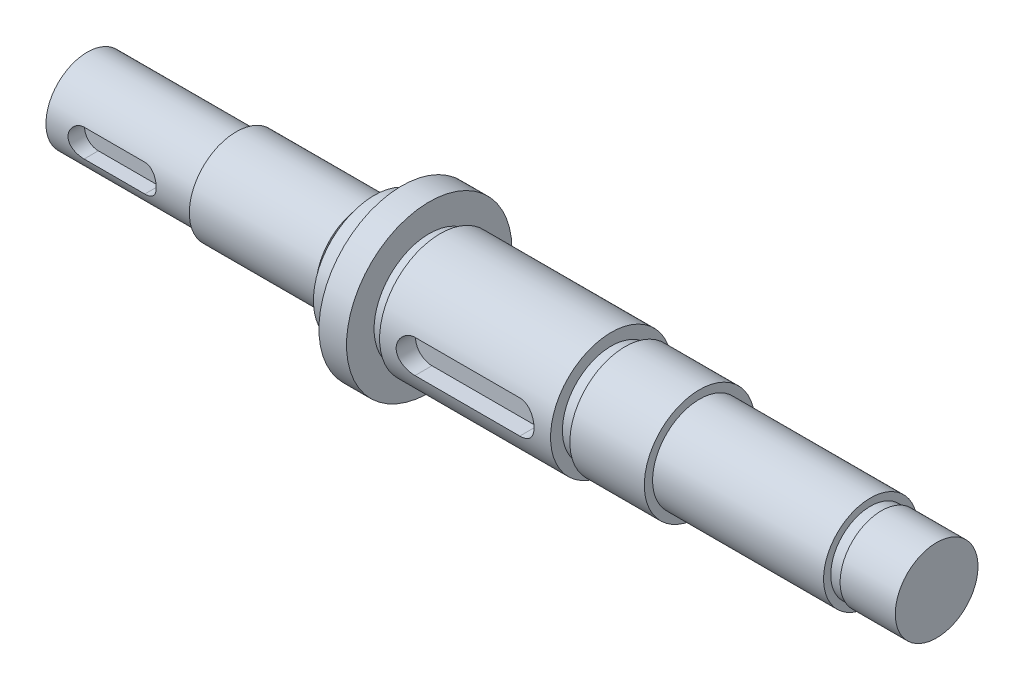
ISO-10303-21;
HEADER;
FILE_DESCRIPTION(('STEP AP214'),'2;1');
FILE_NAME('part.step','',(''),(''),'','','');
FILE_SCHEMA(('AUTOMOTIVE_DESIGN { 1 0 10303 214 1 1 1 1 }'));
ENDSEC;
DATA;
#1=APPLICATION_CONTEXT('core data for automotive mechanical design processes');
#2=APPLICATION_PROTOCOL_DEFINITION('international standard','automotive_design',2000,#1);
#3=PRODUCT_CONTEXT('',#1,'mechanical');
#4=PRODUCT('Part','Part','',(#3));
#5=PRODUCT_RELATED_PRODUCT_CATEGORY('part','',(#4));
#6=PRODUCT_DEFINITION_FORMATION('','',#4);
#7=PRODUCT_DEFINITION_CONTEXT('part definition',#1,'design');
#8=PRODUCT_DEFINITION('design','',#6,#7);
#9=PRODUCT_DEFINITION_SHAPE('','',#8);
#10=(LENGTH_UNIT() NAMED_UNIT(*) SI_UNIT(.MILLI.,.METRE.));
#11=(NAMED_UNIT(*) PLANE_ANGLE_UNIT() SI_UNIT($,.RADIAN.));
#12=(NAMED_UNIT(*) SI_UNIT($,.STERADIAN.) SOLID_ANGLE_UNIT());
#13=UNCERTAINTY_MEASURE_WITH_UNIT(LENGTH_MEASURE(1.E-05),#10,'distance_accuracy_value','');
#14=(GEOMETRIC_REPRESENTATION_CONTEXT(3) GLOBAL_UNCERTAINTY_ASSIGNED_CONTEXT((#13)) GLOBAL_UNIT_ASSIGNED_CONTEXT((#10,
#11,#12)) REPRESENTATION_CONTEXT('',''));
#15=CARTESIAN_POINT('',(0.,0.,0.));
#16=DIRECTION('',(0.,0.,1.));
#17=DIRECTION('',(1.,0.,0.));
#18=AXIS2_PLACEMENT_3D('',#15,#16,#17);
#19=CARTESIAN_POINT('',(142.,0.,0.));
#20=DIRECTION('',(1.,0.,0.));
#21=DIRECTION('',(0.,0.,-1.));
#22=AXIS2_PLACEMENT_3D('',#19,#20,#21);
#23=PLANE('',#22);
#24=CARTESIAN_POINT('',(142.,0.,0.));
#25=DIRECTION('',(1.,0.,0.));
#26=DIRECTION('',(0.,0.,-1.));
#27=AXIS2_PLACEMENT_3D('',#24,#25,#26);
#28=CIRCLE('',#27,8.5);
#29=CARTESIAN_POINT('',(142.,0.,-8.5));
#30=VERTEX_POINT('',#29);
#31=EDGE_CURVE('E164',#30,#30,#28,.T.);
#32=ORIENTED_EDGE('',*,*,#31,.T.);
#33=EDGE_LOOP('',(#32));
#34=FACE_BOUND('',#33,.T.);
#35=CARTESIAN_POINT('',(142.,0.,0.));
#36=DIRECTION('',(1.,0.,0.));
#37=DIRECTION('',(0.,0.,-1.));
#38=AXIS2_PLACEMENT_3D('',#35,#36,#37);
#39=CIRCLE('',#38,7.2);
#40=CARTESIAN_POINT('',(142.,0.,-7.2));
#41=VERTEX_POINT('',#40);
#42=EDGE_CURVE('E155',#41,#41,#39,.T.);
#43=ORIENTED_EDGE('',*,*,#42,.F.);
#44=EDGE_LOOP('',(#43));
#45=FACE_BOUND('',#44,.T.);
#46=ADVANCED_FACE('F31',(#34,#45),#23,.T.);
#47=CARTESIAN_POINT('',(111.,0.,0.));
#48=DIRECTION('',(1.,0.,0.));
#49=DIRECTION('',(0.,0.,-1.));
#50=AXIS2_PLACEMENT_3D('',#47,#48,#49);
#51=PLANE('',#50);
#52=CARTESIAN_POINT('',(111.,0.,0.));
#53=DIRECTION('',(1.,0.,0.));
#54=DIRECTION('',(0.,0.,-1.));
#55=AXIS2_PLACEMENT_3D('',#52,#53,#54);
#56=CIRCLE('',#55,10.);
#57=CARTESIAN_POINT('',(111.,0.,-10.));
#58=VERTEX_POINT('',#57);
#59=EDGE_CURVE('E170',#58,#58,#56,.T.);
#60=ORIENTED_EDGE('',*,*,#59,.T.);
#61=EDGE_LOOP('',(#60));
#62=FACE_BOUND('',#61,.T.);
#63=CARTESIAN_POINT('',(111.,0.,0.));
#64=DIRECTION('',(1.,0.,0.));
#65=DIRECTION('',(0.,0.,-1.));
#66=AXIS2_PLACEMENT_3D('',#63,#64,#65);
#67=CIRCLE('',#66,8.5);
#68=CARTESIAN_POINT('',(111.,0.,-8.5));
#69=VERTEX_POINT('',#68);
#70=EDGE_CURVE('E161',#69,#69,#67,.T.);
#71=ORIENTED_EDGE('',*,*,#70,.F.);
#72=EDGE_LOOP('',(#71));
#73=FACE_BOUND('',#72,.T.);
#74=ADVANCED_FACE('F270',(#62,#73),#51,.T.);
#75=CARTESIAN_POINT('',(95.,0.,0.));
#76=DIRECTION('',(1.,0.,0.));
#77=DIRECTION('',(0.,0.,-1.));
#78=AXIS2_PLACEMENT_3D('',#75,#76,#77);
#79=PLANE('',#78);
#80=CARTESIAN_POINT('',(95.,0.,0.));
#81=DIRECTION('',(1.,0.,0.));
#82=DIRECTION('',(0.,0.,-1.));
#83=AXIS2_PLACEMENT_3D('',#80,#81,#82);
#84=CIRCLE('',#83,11.);
#85=CARTESIAN_POINT('',(95.,0.,-11.));
#86=VERTEX_POINT('',#85);
#87=EDGE_CURVE('E182',#86,#86,#84,.T.);
#88=ORIENTED_EDGE('',*,*,#87,.T.);
#89=EDGE_LOOP('',(#88));
#90=FACE_BOUND('',#89,.T.);
#91=CARTESIAN_POINT('',(95.,0.,0.));
#92=DIRECTION('',(1.,0.,0.));
#93=DIRECTION('',(0.,0.,-1.));
#94=AXIS2_PLACEMENT_3D('',#91,#92,#93);
#95=CIRCLE('',#94,8.85);
#96=CARTESIAN_POINT('',(95.,0.,-8.85));
#97=VERTEX_POINT('',#96);
#98=EDGE_CURVE('E173',#97,#97,#95,.T.);
#99=ORIENTED_EDGE('',*,*,#98,.F.);
#100=EDGE_LOOP('',(#99));
#101=FACE_BOUND('',#100,.T.);
#102=ADVANCED_FACE('F278',(#90,#101),#79,.T.);
#103=CARTESIAN_POINT('',(62.,0.,0.));
#104=DIRECTION('',(1.,0.,0.));
#105=DIRECTION('',(0.,0.,-1.));
#106=AXIS2_PLACEMENT_3D('',#103,#104,#105);
#107=PLANE('',#106);
#108=CARTESIAN_POINT('',(62.,0.,0.));
#109=DIRECTION('',(1.,0.,0.));
#110=DIRECTION('',(0.,0.,-1.));
#111=AXIS2_PLACEMENT_3D('',#108,#109,#110);
#112=CIRCLE('',#111,15.);
#113=CARTESIAN_POINT('',(62.,0.,-15.));
#114=VERTEX_POINT('',#113);
#115=EDGE_CURVE('E194',#114,#114,#112,.T.);
#116=ORIENTED_EDGE('',*,*,#115,.T.);
#117=EDGE_LOOP('',(#116));
#118=FACE_BOUND('',#117,.T.);
#119=CARTESIAN_POINT('',(62.,0.,0.));
#120=DIRECTION('',(1.,0.,0.));
#121=DIRECTION('',(0.,0.,-1.));
#122=AXIS2_PLACEMENT_3D('',#119,#120,#121);
#123=CIRCLE('',#122,10.);
#124=CARTESIAN_POINT('',(62.,0.,-10.));
#125=VERTEX_POINT('',#124);
#126=EDGE_CURVE('E185',#125,#125,#123,.T.);
#127=ORIENTED_EDGE('',*,*,#126,.F.);
#128=EDGE_LOOP('',(#127));
#129=FACE_BOUND('',#128,.T.);
#130=ADVANCED_FACE('F294',(#118,#129),#107,.T.);
#131=CARTESIAN_POINT('',(50.,0.,0.));
#132=DIRECTION('',(1.,0.,0.));
#133=DIRECTION('',(0.,0.,-1.));
#134=AXIS2_PLACEMENT_3D('',#131,#132,#133);
#135=PLANE('',#134);
#136=CARTESIAN_POINT('',(50.,0.,0.));
#137=DIRECTION('',(1.,0.,0.));
#138=DIRECTION('',(0.,0.,-1.));
#139=AXIS2_PLACEMENT_3D('',#136,#137,#138);
#140=CIRCLE('',#139,8.5);
#141=CARTESIAN_POINT('',(50.,0.,-8.5));
#142=VERTEX_POINT('',#141);
#143=EDGE_CURVE('E212',#142,#142,#140,.T.);
#144=ORIENTED_EDGE('',*,*,#143,.T.);
#145=EDGE_LOOP('',(#144));
#146=FACE_BOUND('',#145,.T.);
#147=CARTESIAN_POINT('',(50.,0.,0.));
#148=DIRECTION('',(1.,0.,0.));
#149=DIRECTION('',(0.,0.,-1.));
#150=AXIS2_PLACEMENT_3D('',#147,#148,#149);
#151=CIRCLE('',#150,8.2);
#152=CARTESIAN_POINT('',(50.,0.,-8.2));
#153=VERTEX_POINT('',#152);
#154=EDGE_CURVE('E203',#153,#153,#151,.T.);
#155=ORIENTED_EDGE('',*,*,#154,.F.);
#156=EDGE_LOOP('',(#155));
#157=FACE_BOUND('',#156,.T.);
#158=ADVANCED_FACE('F341',(#146,#157),#135,.T.);
#159=CARTESIAN_POINT('',(27.,0.,0.));
#160=DIRECTION('',(-1.,0.,0.));
#161=DIRECTION('',(0.,0.,1.));
#162=AXIS2_PLACEMENT_3D('',#159,#160,#161);
#163=CYLINDRICAL_SURFACE('',#162,7.5);
#164=DIRECTION('',(-1.,0.,0.));
#165=VECTOR('',#164,1.);
#166=CARTESIAN_POINT('',(27.,2.5,7.07106781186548));
#167=LINE('',#166,#165);
#168=CARTESIAN_POINT('',(6.5,2.5,7.07106781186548));
#169=VERTEX_POINT('',#168);
#170=CARTESIAN_POINT('',(17.5,2.5,7.07106781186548));
#171=VERTEX_POINT('',#170);
#172=EDGE_CURVE('E335',#169,#171,#167,.F.);
#173=ORIENTED_EDGE('',*,*,#172,.T.);
#174=CARTESIAN_POINT('',(17.5,2.5,7.07106781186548));
#175=CARTESIAN_POINT('',(17.5682070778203,2.50000899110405,7.07105693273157));
#176=CARTESIAN_POINT('',(17.6364080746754,2.49720887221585,7.07205443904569));
#177=CARTESIAN_POINT('',(17.7722810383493,2.4860604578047,7.07598524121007));
#178=CARTESIAN_POINT('',(17.8399531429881,2.47771365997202,7.07891801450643));
#179=CARTESIAN_POINT('',(17.9740904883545,2.45557459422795,7.08662705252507));
#180=CARTESIAN_POINT('',(18.0405587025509,2.44179847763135,7.09139784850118));
#181=CARTESIAN_POINT('',(18.1720082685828,2.4089418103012,7.10262619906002));
#182=CARTESIAN_POINT('',(18.2369895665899,2.38986106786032,7.10908381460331));
#183=CARTESIAN_POINT('',(18.4289615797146,2.32491551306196,7.13069940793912));
#184=CARTESIAN_POINT('',(18.55317915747,2.2713141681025,7.14811243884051));
#185=CARTESIAN_POINT('',(18.7908768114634,2.14517784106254,7.1869703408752));
#186=CARTESIAN_POINT('',(18.9043502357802,2.07263123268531,7.20841768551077));
#187=CARTESIAN_POINT('',(19.1217929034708,1.90762995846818,7.25386182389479));
#188=CARTESIAN_POINT('',(19.2252851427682,1.81456284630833,7.27792189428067));
#189=CARTESIAN_POINT('',(19.4155171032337,1.61247071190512,7.32534626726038));
#190=CARTESIAN_POINT('',(19.502253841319,1.50344285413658,7.34871044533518));
#191=CARTESIAN_POINT('',(19.6586982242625,1.26900922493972,7.39284706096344));
#192=CARTESIAN_POINT('',(19.7279023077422,1.14325025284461,7.41353593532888));
#193=CARTESIAN_POINT('',(19.8439807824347,0.881073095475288,7.44924021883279));
#194=CARTESIAN_POINT('',(19.8908619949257,0.744658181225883,7.46425736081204));
#195=CARTESIAN_POINT('',(19.9593392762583,0.470073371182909,7.48647677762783));
#196=CARTESIAN_POINT('',(19.9817581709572,0.332129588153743,7.49393272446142));
#197=CARTESIAN_POINT('',(20.0032907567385,0.0542474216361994,7.50109021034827));
#198=CARTESIAN_POINT('',(20.0024100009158,-0.0856904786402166,7.50079359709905));
#199=CARTESIAN_POINT('',(19.9778892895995,-0.357759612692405,7.49265096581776));
#200=CARTESIAN_POINT('',(19.9551434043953,-0.489981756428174,7.48510152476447));
#201=CARTESIAN_POINT('',(19.8890170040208,-0.748610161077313,7.46367401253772));
#202=CARTESIAN_POINT('',(19.8456353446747,-0.875016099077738,7.44979559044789));
#203=CARTESIAN_POINT('',(19.7389465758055,-1.12038155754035,7.41689170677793));
#204=CARTESIAN_POINT('',(19.6753848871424,-1.23922126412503,7.39780094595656));
#205=CARTESIAN_POINT('',(19.530350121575,-1.46481147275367,7.35645969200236));
#206=CARTESIAN_POINT('',(19.4488721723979,-1.57155867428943,7.33420833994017));
#207=CARTESIAN_POINT('',(19.2658223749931,-1.77524334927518,7.28765679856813));
#208=CARTESIAN_POINT('',(19.1634861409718,-1.87148402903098,7.26330946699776));
#209=CARTESIAN_POINT('',(18.9438962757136,-2.04568006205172,7.21618726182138));
#210=CARTESIAN_POINT('',(18.826637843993,-2.12362950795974,7.19341289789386));
#211=CARTESIAN_POINT('',(18.5782995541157,-2.26000831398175,7.15175078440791));
#212=CARTESIAN_POINT('',(18.4470412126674,-2.31813252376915,7.13292537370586));
#213=CARTESIAN_POINT('',(18.1758825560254,-2.41115057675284,7.10202742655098));
#214=CARTESIAN_POINT('',(18.0359962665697,-2.4460810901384,7.08994423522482));
#215=CARTESIAN_POINT('',(17.82895340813,-2.47914539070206,7.078413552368));
#216=CARTESIAN_POINT('',(17.7633965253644,-2.48696265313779,7.07566669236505));
#217=CARTESIAN_POINT('',(17.6319048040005,-2.49738654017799,7.07199258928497));
#218=CARTESIAN_POINT('',(17.565970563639,-2.49999988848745,7.0710629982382));
#219=CARTESIAN_POINT('',(17.5,-2.5,7.07106781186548));
#220=B_SPLINE_CURVE_WITH_KNOTS('',3,(#174,#175,#176,#177,#178,#179,#180,#181,#182,#183,#184,
#185,#186,#187,#188,#189,#190,#191,#192,#193,#194,#195,#196,#197,#198,#199,#200,#201,#202,#203,
#204,#205,#206,#207,#208,#209,#210,#211,#212,#213,#214,#215,#216,#217,#218,#219),.UNSPECIFIED.,
.F.,.F.,(4,2,2,2,2,2,2,2,2,2,2,2,2,2,2,2,2,2,2,2,2,2,4),(0.,0.204546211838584,0.409037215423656,
0.612924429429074,0.816819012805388,1.22401016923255,1.63145179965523,2.05327864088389,
2.47518051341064,2.90809434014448,3.34087579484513,3.75860278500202,4.17623021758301,
4.57747647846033,4.97874498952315,5.38529148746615,5.79194868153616,6.21771736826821,
6.64362337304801,7.07581676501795,7.50732520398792,7.70536340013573,7.90314555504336),.UNSPECIFIED.);
#221=CARTESIAN_POINT('',(17.5,-2.5,7.07106781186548));
#222=VERTEX_POINT('',#221);
#223=EDGE_CURVE('E221',#171,#222,#220,.T.);
#224=ORIENTED_EDGE('',*,*,#223,.T.);
#225=DIRECTION('',(-1.,0.,0.));
#226=VECTOR('',#225,1.);
#227=CARTESIAN_POINT('',(27.,-2.5,7.07106781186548));
#228=LINE('',#227,#226);
#229=CARTESIAN_POINT('',(6.5,-2.5,7.07106781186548));
#230=VERTEX_POINT('',#229);
#231=EDGE_CURVE('E332',#222,#230,#228,.T.);
#232=ORIENTED_EDGE('',*,*,#231,.T.);
#233=CARTESIAN_POINT('',(6.5,-2.5,7.07106781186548));
#234=CARTESIAN_POINT('',(6.43179292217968,-2.50000899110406,7.07105693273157));
#235=CARTESIAN_POINT('',(6.36359192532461,-2.49720887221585,7.07205443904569));
#236=CARTESIAN_POINT('',(6.22771896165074,-2.4860604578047,7.07598524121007));
#237=CARTESIAN_POINT('',(6.16004685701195,-2.47771365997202,7.07891801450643));
#238=CARTESIAN_POINT('',(6.02590951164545,-2.45557459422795,7.08662705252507));
#239=CARTESIAN_POINT('',(5.95944129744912,-2.44179847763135,7.09139784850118));
#240=CARTESIAN_POINT('',(5.82799173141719,-2.4089418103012,7.10262619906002));
#241=CARTESIAN_POINT('',(5.7630104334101,-2.38986106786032,7.10908381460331));
#242=CARTESIAN_POINT('',(5.57103842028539,-2.32491551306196,7.13069940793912));
#243=CARTESIAN_POINT('',(5.44682084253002,-2.2713141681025,7.14811243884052));
#244=CARTESIAN_POINT('',(5.20912318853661,-2.14517784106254,7.1869703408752));
#245=CARTESIAN_POINT('',(5.09564976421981,-2.07263123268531,7.20841768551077));
#246=CARTESIAN_POINT('',(4.8782070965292,-1.90762995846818,7.25386182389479));
#247=CARTESIAN_POINT('',(4.7747148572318,-1.81456284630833,7.27792189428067));
#248=CARTESIAN_POINT('',(4.58448289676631,-1.61247071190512,7.32534626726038));
#249=CARTESIAN_POINT('',(4.497746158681,-1.50344285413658,7.34871044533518));
#250=CARTESIAN_POINT('',(4.34130177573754,-1.26900922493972,7.39284706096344));
#251=CARTESIAN_POINT('',(4.27209769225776,-1.1432502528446,7.41353593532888));
#252=CARTESIAN_POINT('',(4.1560192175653,-0.881073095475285,7.44924021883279));
#253=CARTESIAN_POINT('',(4.10913800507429,-0.744658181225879,7.46425736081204));
#254=CARTESIAN_POINT('',(4.04066072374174,-0.470073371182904,7.48647677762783));
#255=CARTESIAN_POINT('',(4.01824182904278,-0.332129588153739,7.49393272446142));
#256=CARTESIAN_POINT('',(3.99670924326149,-0.0542474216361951,7.50109021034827));
#257=CARTESIAN_POINT('',(3.99758999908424,0.0856904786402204,7.50079359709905));
#258=CARTESIAN_POINT('',(4.0221107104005,0.357759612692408,7.49265096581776));
#259=CARTESIAN_POINT('',(4.04485659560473,0.489981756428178,7.48510152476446));
#260=CARTESIAN_POINT('',(4.11098299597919,0.748610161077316,7.46367401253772));
#261=CARTESIAN_POINT('',(4.15436465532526,0.875016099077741,7.44979559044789));
#262=CARTESIAN_POINT('',(4.26105342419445,1.12038155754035,7.41689170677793));
#263=CARTESIAN_POINT('',(4.32461511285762,1.23922126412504,7.39780094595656));
#264=CARTESIAN_POINT('',(4.46964987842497,1.46481147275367,7.35645969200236));
#265=CARTESIAN_POINT('',(4.55112782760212,1.57155867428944,7.33420833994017));
#266=CARTESIAN_POINT('',(4.73417762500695,1.77524334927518,7.28765679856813));
#267=CARTESIAN_POINT('',(4.83651385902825,1.87148402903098,7.26330946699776));
#268=CARTESIAN_POINT('',(5.05610372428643,2.04568006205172,7.21618726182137));
#269=CARTESIAN_POINT('',(5.17336215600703,2.12362950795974,7.19341289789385));
#270=CARTESIAN_POINT('',(5.42170044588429,2.26000831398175,7.15175078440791));
#271=CARTESIAN_POINT('',(5.55295878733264,2.31813252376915,7.13292537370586));
#272=CARTESIAN_POINT('',(5.8241174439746,2.41115057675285,7.10202742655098));
#273=CARTESIAN_POINT('',(5.96400373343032,2.4460810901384,7.08994423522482));
#274=CARTESIAN_POINT('',(6.17104659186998,2.47914539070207,7.078413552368));
#275=CARTESIAN_POINT('',(6.23660347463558,2.48696265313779,7.07566669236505));
#276=CARTESIAN_POINT('',(6.36809519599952,2.49738654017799,7.07199258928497));
#277=CARTESIAN_POINT('',(6.43402943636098,2.49999988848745,7.0710629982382));
#278=CARTESIAN_POINT('',(6.5,2.5,7.07106781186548));
#279=B_SPLINE_CURVE_WITH_KNOTS('',3,(#233,#234,#235,#236,#237,#238,#239,#240,#241,#242,#243,
#244,#245,#246,#247,#248,#249,#250,#251,#252,#253,#254,#255,#256,#257,#258,#259,#260,#261,#262,
#263,#264,#265,#266,#267,#268,#269,#270,#271,#272,#273,#274,#275,#276,#277,#278),.UNSPECIFIED.,
.F.,.F.,(4,2,2,2,2,2,2,2,2,2,2,2,2,2,2,2,2,2,2,2,2,2,4),(0.,0.204546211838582,0.409037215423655,
0.612924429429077,0.816819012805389,1.22401016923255,1.63145179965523,2.0532786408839,
2.47518051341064,2.90809434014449,3.34087579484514,3.75860278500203,4.17623021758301,
4.57747647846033,4.97874498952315,5.38529148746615,5.79194868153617,6.21771736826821,
6.64362337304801,7.07581676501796,7.50732520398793,7.70536340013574,7.90314555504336),.UNSPECIFIED.);
#280=EDGE_CURVE('E55',#230,#169,#279,.T.);
#281=ORIENTED_EDGE('',*,*,#280,.T.);
#282=EDGE_LOOP('',(#173,#224,#232,#281));
#283=FACE_BOUND('',#282,.T.);
#284=CARTESIAN_POINT('',(27.,0.,0.));
#285=DIRECTION('',(1.,0.,0.));
#286=DIRECTION('',(0.,0.,-1.));
#287=AXIS2_PLACEMENT_3D('',#284,#285,#286);
#288=CIRCLE('',#287,7.5);
#289=CARTESIAN_POINT('',(27.,0.,-7.5));
#290=VERTEX_POINT('',#289);
#291=EDGE_CURVE('E218',#290,#290,#288,.T.);
#292=ORIENTED_EDGE('',*,*,#291,.F.);
#293=EDGE_LOOP('',(#292));
#294=FACE_BOUND('',#293,.T.);
#295=CARTESIAN_POINT('',(0.,0.,0.));
#296=DIRECTION('',(1.,0.,0.));
#297=DIRECTION('',(0.,0.,-1.));
#298=AXIS2_PLACEMENT_3D('',#295,#296,#297);
#299=CIRCLE('',#298,7.5);
#300=CARTESIAN_POINT('',(0.,0.,-7.5));
#301=VERTEX_POINT('',#300);
#302=EDGE_CURVE('E215',#301,#301,#299,.T.);
#303=ORIENTED_EDGE('',*,*,#302,.T.);
#304=EDGE_LOOP('',(#303));
#305=FACE_BOUND('',#304,.T.);
#306=ADVANCED_FACE('F33',(#283,#294,#305),#163,.T.);
#307=CARTESIAN_POINT('',(0.,0.,0.));
#308=DIRECTION('',(1.,0.,0.));
#309=DIRECTION('',(0.,0.,-1.));
#310=AXIS2_PLACEMENT_3D('',#307,#308,#309);
#311=PLANE('',#310);
#312=ORIENTED_EDGE('',*,*,#302,.F.);
#313=EDGE_LOOP('',(#312));
#314=FACE_BOUND('',#313,.T.);
#315=ADVANCED_FACE('F340',(#314),#311,.F.);
#316=CARTESIAN_POINT('',(27.,0.,0.));
#317=DIRECTION('',(1.,0.,0.));
#318=DIRECTION('',(0.,0.,-1.));
#319=AXIS2_PLACEMENT_3D('',#316,#317,#318);
#320=PLANE('',#319);
#321=CARTESIAN_POINT('',(27.,0.,0.));
#322=DIRECTION('',(1.,0.,0.));
#323=DIRECTION('',(0.,0.,-1.));
#324=AXIS2_PLACEMENT_3D('',#321,#322,#323);
#325=CIRCLE('',#324,8.5);
#326=CARTESIAN_POINT('',(27.,0.,-8.5));
#327=VERTEX_POINT('',#326);
#328=EDGE_CURVE('E209',#327,#327,#325,.T.);
#329=ORIENTED_EDGE('',*,*,#328,.F.);
#330=EDGE_LOOP('',(#329));
#331=FACE_BOUND('',#330,.T.);
#332=ORIENTED_EDGE('',*,*,#291,.T.);
#333=EDGE_LOOP('',(#332));
#334=FACE_BOUND('',#333,.T.);
#335=ADVANCED_FACE('F347',(#331,#334),#320,.F.);
#336=CARTESIAN_POINT('',(50.,0.,0.));
#337=DIRECTION('',(-1.,0.,0.));
#338=DIRECTION('',(0.,0.,1.));
#339=AXIS2_PLACEMENT_3D('',#336,#337,#338);
#340=CYLINDRICAL_SURFACE('',#339,8.5);
#341=ORIENTED_EDGE('',*,*,#143,.F.);
#342=EDGE_LOOP('',(#341));
#343=FACE_BOUND('',#342,.T.);
#344=ORIENTED_EDGE('',*,*,#328,.T.);
#345=EDGE_LOOP('',(#344));
#346=FACE_BOUND('',#345,.T.);
#347=ADVANCED_FACE('F351',(#343,#346),#340,.T.);
#348=CARTESIAN_POINT('',(52.,0.,0.));
#349=DIRECTION('',(-1.,0.,0.));
#350=DIRECTION('',(0.,0.,1.));
#351=AXIS2_PLACEMENT_3D('',#348,#349,#350);
#352=CYLINDRICAL_SURFACE('',#351,8.2);
#353=CARTESIAN_POINT('',(52.,0.,0.));
#354=DIRECTION('',(1.,0.,0.));
#355=DIRECTION('',(0.,0.,-1.));
#356=AXIS2_PLACEMENT_3D('',#353,#354,#355);
#357=CIRCLE('',#356,8.2);
#358=CARTESIAN_POINT('',(52.,0.,-8.2));
#359=VERTEX_POINT('',#358);
#360=EDGE_CURVE('E206',#359,#359,#357,.T.);
#361=ORIENTED_EDGE('',*,*,#360,.F.);
#362=EDGE_LOOP('',(#361));
#363=FACE_BOUND('',#362,.T.);
#364=ORIENTED_EDGE('',*,*,#154,.T.);
#365=EDGE_LOOP('',(#364));
#366=FACE_BOUND('',#365,.T.);
#367=ADVANCED_FACE('F356',(#363,#366),#352,.T.);
#368=CARTESIAN_POINT('',(52.,0.,0.));
#369=DIRECTION('',(1.,0.,0.));
#370=DIRECTION('',(0.,0.,-1.));
#371=AXIS2_PLACEMENT_3D('',#368,#369,#370);
#372=PLANE('',#371);
#373=CARTESIAN_POINT('',(52.,0.,0.));
#374=DIRECTION('',(1.,0.,0.));
#375=DIRECTION('',(0.,0.,-1.));
#376=AXIS2_PLACEMENT_3D('',#373,#374,#375);
#377=CIRCLE('',#376,11.);
#378=CARTESIAN_POINT('',(52.,0.,-11.));
#379=VERTEX_POINT('',#378);
#380=EDGE_CURVE('E197',#379,#379,#377,.T.);
#381=ORIENTED_EDGE('',*,*,#380,.F.);
#382=EDGE_LOOP('',(#381));
#383=FACE_BOUND('',#382,.T.);
#384=ORIENTED_EDGE('',*,*,#360,.T.);
#385=EDGE_LOOP('',(#384));
#386=FACE_BOUND('',#385,.T.);
#387=ADVANCED_FACE('F364',(#383,#386),#372,.F.);
#388=CARTESIAN_POINT('',(57.,0.,0.));
#389=DIRECTION('',(-1.,0.,0.));
#390=DIRECTION('',(0.,0.,1.));
#391=AXIS2_PLACEMENT_3D('',#388,#389,#390);
#392=CYLINDRICAL_SURFACE('',#391,11.);
#393=CARTESIAN_POINT('',(57.,0.,0.));
#394=DIRECTION('',(1.,0.,0.));
#395=DIRECTION('',(0.,0.,-1.));
#396=AXIS2_PLACEMENT_3D('',#393,#394,#395);
#397=CIRCLE('',#396,11.);
#398=CARTESIAN_POINT('',(57.,0.,-11.));
#399=VERTEX_POINT('',#398);
#400=EDGE_CURVE('E200',#399,#399,#397,.T.);
#401=ORIENTED_EDGE('',*,*,#400,.F.);
#402=EDGE_LOOP('',(#401));
#403=FACE_BOUND('',#402,.T.);
#404=ORIENTED_EDGE('',*,*,#380,.T.);
#405=EDGE_LOOP('',(#404));
#406=FACE_BOUND('',#405,.T.);
#407=ADVANCED_FACE('F366',(#403,#406),#392,.T.);
#408=CARTESIAN_POINT('',(57.,0.,0.));
#409=DIRECTION('',(1.,0.,0.));
#410=DIRECTION('',(0.,0.,-1.));
#411=AXIS2_PLACEMENT_3D('',#408,#409,#410);
#412=PLANE('',#411);
#413=CARTESIAN_POINT('',(57.,0.,0.));
#414=DIRECTION('',(1.,0.,0.));
#415=DIRECTION('',(0.,0.,-1.));
#416=AXIS2_PLACEMENT_3D('',#413,#414,#415);
#417=CIRCLE('',#416,15.);
#418=CARTESIAN_POINT('',(57.,0.,-15.));
#419=VERTEX_POINT('',#418);
#420=EDGE_CURVE('E191',#419,#419,#417,.T.);
#421=ORIENTED_EDGE('',*,*,#420,.F.);
#422=EDGE_LOOP('',(#421));
#423=FACE_BOUND('',#422,.T.);
#424=ORIENTED_EDGE('',*,*,#400,.T.);
#425=EDGE_LOOP('',(#424));
#426=FACE_BOUND('',#425,.T.);
#427=ADVANCED_FACE('F369',(#423,#426),#412,.F.);
#428=CARTESIAN_POINT('',(62.,0.,0.));
#429=DIRECTION('',(-1.,0.,0.));
#430=DIRECTION('',(0.,0.,1.));
#431=AXIS2_PLACEMENT_3D('',#428,#429,#430);
#432=CYLINDRICAL_SURFACE('',#431,15.);
#433=ORIENTED_EDGE('',*,*,#115,.F.);
#434=EDGE_LOOP('',(#433));
#435=FACE_BOUND('',#434,.T.);
#436=ORIENTED_EDGE('',*,*,#420,.T.);
#437=EDGE_LOOP('',(#436));
#438=FACE_BOUND('',#437,.T.);
#439=ADVANCED_FACE('F374',(#435,#438),#432,.T.);
#440=CARTESIAN_POINT('',(64.,0.,0.));
#441=DIRECTION('',(-1.,0.,0.));
#442=DIRECTION('',(0.,0.,1.));
#443=AXIS2_PLACEMENT_3D('',#440,#441,#442);
#444=CYLINDRICAL_SURFACE('',#443,10.);
#445=CARTESIAN_POINT('',(64.,0.,0.));
#446=DIRECTION('',(1.,0.,0.));
#447=DIRECTION('',(0.,0.,-1.));
#448=AXIS2_PLACEMENT_3D('',#445,#446,#447);
#449=CIRCLE('',#448,10.);
#450=CARTESIAN_POINT('',(64.,0.,-10.));
#451=VERTEX_POINT('',#450);
#452=EDGE_CURVE('E188',#451,#451,#449,.T.);
#453=ORIENTED_EDGE('',*,*,#452,.F.);
#454=EDGE_LOOP('',(#453));
#455=FACE_BOUND('',#454,.T.);
#456=ORIENTED_EDGE('',*,*,#126,.T.);
#457=EDGE_LOOP('',(#456));
#458=FACE_BOUND('',#457,.T.);
#459=ADVANCED_FACE('F299',(#455,#458),#444,.T.);
#460=CARTESIAN_POINT('',(64.,0.,0.));
#461=DIRECTION('',(1.,0.,0.));
#462=DIRECTION('',(0.,0.,-1.));
#463=AXIS2_PLACEMENT_3D('',#460,#461,#462);
#464=PLANE('',#463);
#465=CARTESIAN_POINT('',(64.,0.,0.));
#466=DIRECTION('',(1.,0.,0.));
#467=DIRECTION('',(0.,0.,-1.));
#468=AXIS2_PLACEMENT_3D('',#465,#466,#467);
#469=CIRCLE('',#468,11.);
#470=CARTESIAN_POINT('',(64.,0.,-11.));
#471=VERTEX_POINT('',#470);
#472=EDGE_CURVE('E179',#471,#471,#469,.T.);
#473=ORIENTED_EDGE('',*,*,#472,.F.);
#474=EDGE_LOOP('',(#473));
#475=FACE_BOUND('',#474,.T.);
#476=ORIENTED_EDGE('',*,*,#452,.T.);
#477=EDGE_LOOP('',(#476));
#478=FACE_BOUND('',#477,.T.);
#479=ADVANCED_FACE('F296',(#475,#478),#464,.F.);
#480=CARTESIAN_POINT('',(95.,0.,0.));
#481=DIRECTION('',(-1.,0.,0.));
#482=DIRECTION('',(0.,0.,1.));
#483=AXIS2_PLACEMENT_3D('',#480,#481,#482);
#484=CYLINDRICAL_SURFACE('',#483,11.);
#485=DIRECTION('',(-1.,0.,0.));
#486=VECTOR('',#485,1.);
#487=CARTESIAN_POINT('',(95.,3.00000000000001,10.5830052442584));
#488=LINE('',#487,#486);
#489=CARTESIAN_POINT('',(70.,3.00000000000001,10.5830052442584));
#490=VERTEX_POINT('',#489);
#491=CARTESIAN_POINT('',(89.,3.00000000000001,10.5830052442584));
#492=VERTEX_POINT('',#491);
#493=EDGE_CURVE('E11',#490,#492,#488,.F.);
#494=ORIENTED_EDGE('',*,*,#493,.T.);
#495=CARTESIAN_POINT('',(89.,3.00000000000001,10.5830052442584));
#496=CARTESIAN_POINT('',(89.0826938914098,3.0000098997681,10.5829949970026));
#497=CARTESIAN_POINT('',(89.165381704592,2.99658102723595,10.5839742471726));
#498=CARTESIAN_POINT('',(89.3301335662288,2.98292268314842,10.5878356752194));
#499=CARTESIAN_POINT('',(89.4121977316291,2.97269452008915,10.5907174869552));
#500=CARTESIAN_POINT('',(89.5749425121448,2.94554459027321,10.598299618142));
#501=CARTESIAN_POINT('',(89.6556257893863,2.92863770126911,10.6029958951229));
#502=CARTESIAN_POINT('',(89.8152032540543,2.8882912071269,10.6140571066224));
#503=CARTESIAN_POINT('',(89.8940974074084,2.8648514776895,10.6204220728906));
#504=CARTESIAN_POINT('',(90.127242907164,2.78500332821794,10.6417494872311));
#505=CARTESIAN_POINT('',(90.2781393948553,2.71903526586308,10.6589535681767));
#506=CARTESIAN_POINT('',(90.5667053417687,2.56365897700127,10.6973836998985));
#507=CARTESIAN_POINT('',(90.704370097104,2.47424245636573,10.7186111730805));
#508=CARTESIAN_POINT('',(90.9662097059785,2.27200424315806,10.7633148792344));
#509=CARTESIAN_POINT('',(91.0899918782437,2.15868225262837,10.7868322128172));
#510=CARTESIAN_POINT('',(91.3170514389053,1.91292298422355,10.8331129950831));
#511=CARTESIAN_POINT('',(91.4203254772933,1.78048258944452,10.8558763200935));
#512=CARTESIAN_POINT('',(91.6050989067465,1.49749198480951,10.8985459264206));
#513=CARTESIAN_POINT('',(91.686203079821,1.34667477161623,10.9183977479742));
#514=CARTESIAN_POINT('',(91.8217484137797,1.03291980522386,10.9525311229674));
#515=CARTESIAN_POINT('',(91.8761955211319,0.869984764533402,10.9668139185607));
#516=CARTESIAN_POINT('',(91.9556017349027,0.540744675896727,10.9879090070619));
#517=CARTESIAN_POINT('',(91.9812343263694,0.374613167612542,10.9948916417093));
#518=CARTESIAN_POINT('',(92.004404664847,0.0402673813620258,11.0011960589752));
#519=CARTESIAN_POINT('',(92.0019467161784,-0.127946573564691,11.0005190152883));
#520=CARTESIAN_POINT('',(91.9694751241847,-0.456980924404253,10.9917041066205));
#521=CARTESIAN_POINT('',(91.9401899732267,-0.617879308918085,10.9837634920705));
#522=CARTESIAN_POINT('',(91.8560747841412,-0.932383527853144,10.9615477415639));
#523=CARTESIAN_POINT('',(91.8012435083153,-1.08598900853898,10.9472722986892));
#524=CARTESIAN_POINT('',(91.667045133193,-1.38338788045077,10.9137016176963));
#525=CARTESIAN_POINT('',(91.5874317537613,-1.52706425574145,10.8943563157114));
#526=CARTESIAN_POINT('',(91.4061201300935,-1.79926098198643,10.8527253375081));
#527=CARTESIAN_POINT('',(91.3044178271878,-1.92777854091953,10.830439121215));
#528=CARTESIAN_POINT('',(91.0779767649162,-2.17034844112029,10.7844948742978));
#529=CARTESIAN_POINT('',(90.952605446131,-2.28380693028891,10.760815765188));
#530=CARTESIAN_POINT('',(90.6843376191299,-2.48826234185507,10.7153886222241));
#531=CARTESIAN_POINT('',(90.541436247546,-2.57925300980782,10.6936411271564));
#532=CARTESIAN_POINT('',(90.240805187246,-2.73667910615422,10.6544469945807));
#533=CARTESIAN_POINT('',(90.0829757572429,-2.80293223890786,10.6370325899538));
#534=CARTESIAN_POINT('',(89.757912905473,-2.90768324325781,10.6088816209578));
#535=CARTESIAN_POINT('',(89.5906940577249,-2.9462229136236,10.598135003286));
#536=CARTESIAN_POINT('',(89.3516455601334,-2.98015870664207,10.588613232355));
#537=CARTESIAN_POINT('',(89.2814835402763,-2.98759962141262,10.5865140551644));
#538=CARTESIAN_POINT('',(89.1408924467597,-2.99751512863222,10.58371035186));
#539=CARTESIAN_POINT('',(89.0704639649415,-2.99999749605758,10.5830036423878));
#540=CARTESIAN_POINT('',(89.,-3.00000000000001,10.5830052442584));
#541=B_SPLINE_CURVE_WITH_KNOTS('',3,(#495,#496,#497,#498,#499,#500,#501,#502,#503,#504,#505,
#506,#507,#508,#509,#510,#511,#512,#513,#514,#515,#516,#517,#518,#519,#520,#521,#522,#523,#524,
#525,#526,#527,#528,#529,#530,#531,#532,#533,#534,#535,#536,#537,#538,#539,#540),.UNSPECIFIED.,
.F.,.F.,(4,2,2,2,2,2,2,2,2,2,2,2,2,2,2,2,2,2,2,2,2,2,4),(0.,0.247994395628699,0.495941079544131,
0.743338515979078,0.99074065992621,1.48499724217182,1.97942888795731,2.4854708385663,
2.99159538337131,3.50622794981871,4.02074566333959,4.52296979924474,5.0251169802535,
5.51402000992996,6.00294672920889,6.4968964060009,6.99093691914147,7.50077286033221,
8.01075056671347,8.52441550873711,9.03730408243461,9.24891043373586,9.46018472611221),.UNSPECIFIED.);
#542=CARTESIAN_POINT('',(89.,-3.00000000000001,10.5830052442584));
#543=VERTEX_POINT('',#542);
#544=EDGE_CURVE('E308',#492,#543,#541,.T.);
#545=ORIENTED_EDGE('',*,*,#544,.T.);
#546=DIRECTION('',(-1.,0.,0.));
#547=VECTOR('',#546,1.);
#548=CARTESIAN_POINT('',(95.,-3.00000000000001,10.5830052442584));
#549=LINE('',#548,#547);
#550=CARTESIAN_POINT('',(70.,-3.00000000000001,10.5830052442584));
#551=VERTEX_POINT('',#550);
#552=EDGE_CURVE('E40',#543,#551,#549,.T.);
#553=ORIENTED_EDGE('',*,*,#552,.T.);
#554=CARTESIAN_POINT('',(70.,-3.00000000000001,10.5830052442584));
#555=CARTESIAN_POINT('',(69.9173061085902,-3.0000098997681,10.5829949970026));
#556=CARTESIAN_POINT('',(69.834618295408,-2.99658102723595,10.5839742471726));
#557=CARTESIAN_POINT('',(69.6698664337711,-2.98292268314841,10.5878356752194));
#558=CARTESIAN_POINT('',(69.5878022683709,-2.97269452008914,10.5907174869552));
#559=CARTESIAN_POINT('',(69.4250574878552,-2.94554459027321,10.598299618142));
#560=CARTESIAN_POINT('',(69.3443742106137,-2.92863770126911,10.6029958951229));
#561=CARTESIAN_POINT('',(69.1847967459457,-2.8882912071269,10.6140571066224));
#562=CARTESIAN_POINT('',(69.1059025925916,-2.8648514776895,10.6204220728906));
#563=CARTESIAN_POINT('',(68.872757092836,-2.78500332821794,10.6417494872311));
#564=CARTESIAN_POINT('',(68.7218606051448,-2.71903526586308,10.6589535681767));
#565=CARTESIAN_POINT('',(68.4332946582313,-2.56365897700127,10.6973836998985));
#566=CARTESIAN_POINT('',(68.295629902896,-2.47424245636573,10.7186111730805));
#567=CARTESIAN_POINT('',(68.0337902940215,-2.27200424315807,10.7633148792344));
#568=CARTESIAN_POINT('',(67.9100081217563,-2.15868225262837,10.7868322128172));
#569=CARTESIAN_POINT('',(67.6829485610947,-1.91292298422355,10.8331129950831));
#570=CARTESIAN_POINT('',(67.5796745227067,-1.78048258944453,10.8558763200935));
#571=CARTESIAN_POINT('',(67.3949010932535,-1.49749198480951,10.8985459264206));
#572=CARTESIAN_POINT('',(67.313796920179,-1.34667477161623,10.9183977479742));
#573=CARTESIAN_POINT('',(67.1782515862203,-1.03291980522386,10.9525311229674));
#574=CARTESIAN_POINT('',(67.1238044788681,-0.869984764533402,10.9668139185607));
#575=CARTESIAN_POINT('',(67.0443982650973,-0.540744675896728,10.9879090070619));
#576=CARTESIAN_POINT('',(67.0187656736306,-0.374613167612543,10.9948916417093));
#577=CARTESIAN_POINT('',(66.995595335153,-0.0402673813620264,11.0011960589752));
#578=CARTESIAN_POINT('',(66.9980532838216,0.127946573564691,11.0005190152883));
#579=CARTESIAN_POINT('',(67.0305248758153,0.456980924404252,10.9917041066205));
#580=CARTESIAN_POINT('',(67.0598100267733,0.617879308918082,10.9837634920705));
#581=CARTESIAN_POINT('',(67.1439252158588,0.932383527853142,10.9615477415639));
#582=CARTESIAN_POINT('',(67.1987564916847,1.08598900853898,10.9472722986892));
#583=CARTESIAN_POINT('',(67.332954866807,1.38338788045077,10.9137016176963));
#584=CARTESIAN_POINT('',(67.4125682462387,1.52706425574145,10.8943563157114));
#585=CARTESIAN_POINT('',(67.5938798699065,1.79926098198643,10.8527253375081));
#586=CARTESIAN_POINT('',(67.6955821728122,1.92777854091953,10.830439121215));
#587=CARTESIAN_POINT('',(67.9220232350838,2.17034844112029,10.7844948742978));
#588=CARTESIAN_POINT('',(68.047394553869,2.28380693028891,10.760815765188));
#589=CARTESIAN_POINT('',(68.3156623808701,2.48826234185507,10.7153886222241));
#590=CARTESIAN_POINT('',(68.458563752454,2.57925300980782,10.6936411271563));
#591=CARTESIAN_POINT('',(68.759194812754,2.73667910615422,10.6544469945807));
#592=CARTESIAN_POINT('',(68.9170242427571,2.80293223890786,10.6370325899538));
#593=CARTESIAN_POINT('',(69.242087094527,2.90768324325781,10.6088816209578));
#594=CARTESIAN_POINT('',(69.4093059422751,2.9462229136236,10.598135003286));
#595=CARTESIAN_POINT('',(69.6483544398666,2.98015870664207,10.588613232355));
#596=CARTESIAN_POINT('',(69.7185164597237,2.98759962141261,10.5865140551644));
#597=CARTESIAN_POINT('',(69.8591075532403,2.99751512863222,10.58371035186));
#598=CARTESIAN_POINT('',(69.9295360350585,2.99999749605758,10.5830036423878));
#599=CARTESIAN_POINT('',(70.,3.00000000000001,10.5830052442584));
#600=B_SPLINE_CURVE_WITH_KNOTS('',3,(#554,#555,#556,#557,#558,#559,#560,#561,#562,#563,#564,
#565,#566,#567,#568,#569,#570,#571,#572,#573,#574,#575,#576,#577,#578,#579,#580,#581,#582,#583,
#584,#585,#586,#587,#588,#589,#590,#591,#592,#593,#594,#595,#596,#597,#598,#599),.UNSPECIFIED.,
.F.,.F.,(4,2,2,2,2,2,2,2,2,2,2,2,2,2,2,2,2,2,2,2,2,2,4),(0.,0.247994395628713,0.495941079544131,
0.743338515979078,0.99074065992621,1.48499724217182,1.97942888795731,2.48547083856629,
2.99159538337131,3.50622794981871,4.02074566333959,4.52296979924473,5.0251169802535,
5.51402000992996,6.00294672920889,6.4968964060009,6.99093691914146,7.50077286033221,
8.01075056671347,8.5244155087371,9.03730408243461,9.24891043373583,9.46018472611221),.UNSPECIFIED.);
#601=EDGE_CURVE('E47',#551,#490,#600,.T.);
#602=ORIENTED_EDGE('',*,*,#601,.T.);
#603=EDGE_LOOP('',(#494,#545,#553,#602));
#604=FACE_BOUND('',#603,.T.);
#605=ORIENTED_EDGE('',*,*,#87,.F.);
#606=EDGE_LOOP('',(#605));
#607=FACE_BOUND('',#606,.T.);
#608=ORIENTED_EDGE('',*,*,#472,.T.);
#609=EDGE_LOOP('',(#608));
#610=FACE_BOUND('',#609,.T.);
#611=ADVANCED_FACE('F290',(#604,#607,#610),#484,.T.);
#612=CARTESIAN_POINT('',(97.5,0.,0.));
#613=DIRECTION('',(-1.,0.,0.));
#614=DIRECTION('',(0.,0.,1.));
#615=AXIS2_PLACEMENT_3D('',#612,#613,#614);
#616=CYLINDRICAL_SURFACE('',#615,8.85);
#617=CARTESIAN_POINT('',(97.5,0.,0.));
#618=DIRECTION('',(1.,0.,0.));
#619=DIRECTION('',(0.,0.,-1.));
#620=AXIS2_PLACEMENT_3D('',#617,#618,#619);
#621=CIRCLE('',#620,8.85);
#622=CARTESIAN_POINT('',(97.5,0.,-8.85));
#623=VERTEX_POINT('',#622);
#624=EDGE_CURVE('E176',#623,#623,#621,.T.);
#625=ORIENTED_EDGE('',*,*,#624,.F.);
#626=EDGE_LOOP('',(#625));
#627=FACE_BOUND('',#626,.T.);
#628=ORIENTED_EDGE('',*,*,#98,.T.);
#629=EDGE_LOOP('',(#628));
#630=FACE_BOUND('',#629,.T.);
#631=ADVANCED_FACE('F283',(#627,#630),#616,.T.);
#632=CARTESIAN_POINT('',(97.5,0.,0.));
#633=DIRECTION('',(1.,0.,0.));
#634=DIRECTION('',(0.,0.,-1.));
#635=AXIS2_PLACEMENT_3D('',#632,#633,#634);
#636=PLANE('',#635);
#637=CARTESIAN_POINT('',(97.5,0.,0.));
#638=DIRECTION('',(1.,0.,0.));
#639=DIRECTION('',(0.,0.,-1.));
#640=AXIS2_PLACEMENT_3D('',#637,#638,#639);
#641=CIRCLE('',#640,10.);
#642=CARTESIAN_POINT('',(97.5,0.,-10.));
#643=VERTEX_POINT('',#642);
#644=EDGE_CURVE('E167',#643,#643,#641,.T.);
#645=ORIENTED_EDGE('',*,*,#644,.F.);
#646=EDGE_LOOP('',(#645));
#647=FACE_BOUND('',#646,.T.);
#648=ORIENTED_EDGE('',*,*,#624,.T.);
#649=EDGE_LOOP('',(#648));
#650=FACE_BOUND('',#649,.T.);
#651=ADVANCED_FACE('F280',(#647,#650),#636,.F.);
#652=CARTESIAN_POINT('',(111.,0.,0.));
#653=DIRECTION('',(-1.,0.,0.));
#654=DIRECTION('',(0.,0.,1.));
#655=AXIS2_PLACEMENT_3D('',#652,#653,#654);
#656=CYLINDRICAL_SURFACE('',#655,10.);
#657=ORIENTED_EDGE('',*,*,#59,.F.);
#658=EDGE_LOOP('',(#657));
#659=FACE_BOUND('',#658,.T.);
#660=ORIENTED_EDGE('',*,*,#644,.T.);
#661=EDGE_LOOP('',(#660));
#662=FACE_BOUND('',#661,.T.);
#663=ADVANCED_FACE('F274',(#659,#662),#656,.T.);
#664=CARTESIAN_POINT('',(142.,0.,0.));
#665=DIRECTION('',(-1.,0.,0.));
#666=DIRECTION('',(0.,0.,1.));
#667=AXIS2_PLACEMENT_3D('',#664,#665,#666);
#668=CYLINDRICAL_SURFACE('',#667,8.5);
#669=ORIENTED_EDGE('',*,*,#31,.F.);
#670=EDGE_LOOP('',(#669));
#671=FACE_BOUND('',#670,.T.);
#672=ORIENTED_EDGE('',*,*,#70,.T.);
#673=EDGE_LOOP('',(#672));
#674=FACE_BOUND('',#673,.T.);
#675=ADVANCED_FACE('F266',(#671,#674),#668,.T.);
#676=CARTESIAN_POINT('',(144.,0.,0.));
#677=DIRECTION('',(-1.,0.,0.));
#678=DIRECTION('',(0.,0.,1.));
#679=AXIS2_PLACEMENT_3D('',#676,#677,#678);
#680=CYLINDRICAL_SURFACE('',#679,7.2);
#681=CARTESIAN_POINT('',(144.,0.,0.));
#682=DIRECTION('',(1.,0.,0.));
#683=DIRECTION('',(0.,0.,-1.));
#684=AXIS2_PLACEMENT_3D('',#681,#682,#683);
#685=CIRCLE('',#684,7.2);
#686=CARTESIAN_POINT('',(144.,0.,-7.2));
#687=VERTEX_POINT('',#686);
#688=EDGE_CURVE('E158',#687,#687,#685,.T.);
#689=ORIENTED_EDGE('',*,*,#688,.F.);
#690=EDGE_LOOP('',(#689));
#691=FACE_BOUND('',#690,.T.);
#692=ORIENTED_EDGE('',*,*,#42,.T.);
#693=EDGE_LOOP('',(#692));
#694=FACE_BOUND('',#693,.T.);
#695=ADVANCED_FACE('F259',(#691,#694),#680,.T.);
#696=CARTESIAN_POINT('',(144.,0.,0.));
#697=DIRECTION('',(1.,0.,0.));
#698=DIRECTION('',(0.,0.,-1.));
#699=AXIS2_PLACEMENT_3D('',#696,#697,#698);
#700=PLANE('',#699);
#701=CARTESIAN_POINT('',(144.,0.,0.));
#702=DIRECTION('',(1.,0.,0.));
#703=DIRECTION('',(0.,0.,-1.));
#704=AXIS2_PLACEMENT_3D('',#701,#702,#703);
#705=CIRCLE('',#704,7.5);
#706=CARTESIAN_POINT('',(144.,0.,-7.5));
#707=VERTEX_POINT('',#706);
#708=EDGE_CURVE('E144',#707,#707,#705,.T.);
#709=ORIENTED_EDGE('',*,*,#708,.F.);
#710=EDGE_LOOP('',(#709));
#711=FACE_BOUND('',#710,.T.);
#712=ORIENTED_EDGE('',*,*,#688,.T.);
#713=EDGE_LOOP('',(#712));
#714=FACE_BOUND('',#713,.T.);
#715=ADVANCED_FACE('F256',(#711,#714),#700,.F.);
#716=CARTESIAN_POINT('',(154.,0.,0.));
#717=DIRECTION('',(-1.,0.,0.));
#718=DIRECTION('',(0.,0.,1.));
#719=AXIS2_PLACEMENT_3D('',#716,#717,#718);
#720=CYLINDRICAL_SURFACE('',#719,7.5);
#721=CARTESIAN_POINT('',(154.,0.,0.));
#722=DIRECTION('',(1.,0.,0.));
#723=DIRECTION('',(0.,0.,-1.));
#724=AXIS2_PLACEMENT_3D('',#721,#722,#723);
#725=CIRCLE('',#724,7.5);
#726=CARTESIAN_POINT('',(154.,0.,-7.5));
#727=VERTEX_POINT('',#726);
#728=EDGE_CURVE('E152',#727,#727,#725,.T.);
#729=ORIENTED_EDGE('',*,*,#728,.F.);
#730=EDGE_LOOP('',(#729));
#731=FACE_BOUND('',#730,.T.);
#732=ORIENTED_EDGE('',*,*,#708,.T.);
#733=EDGE_LOOP('',(#732));
#734=FACE_BOUND('',#733,.T.);
#735=ADVANCED_FACE('F254',(#731,#734),#720,.T.);
#736=CARTESIAN_POINT('',(154.,0.,0.));
#737=DIRECTION('',(1.,0.,0.));
#738=DIRECTION('',(0.,0.,-1.));
#739=AXIS2_PLACEMENT_3D('',#736,#737,#738);
#740=PLANE('',#739);
#741=ORIENTED_EDGE('',*,*,#728,.T.);
#742=EDGE_LOOP('',(#741));
#743=FACE_BOUND('',#742,.T.);
#744=ADVANCED_FACE('F251',(#743),#740,.T.);
#745=CARTESIAN_POINT('',(6.5,0.,4.5));
#746=DIRECTION('',(0.,0.,1.));
#747=DIRECTION('',(1.,0.,0.));
#748=AXIS2_PLACEMENT_3D('',#745,#746,#747);
#749=CYLINDRICAL_SURFACE('',#748,2.5);
#750=DIRECTION('',(0.,0.,1.));
#751=VECTOR('',#750,1.);
#752=CARTESIAN_POINT('',(6.5,-2.5,4.5));
#753=LINE('',#752,#751);
#754=CARTESIAN_POINT('',(6.5,-2.5,4.5));
#755=VERTEX_POINT('',#754);
#756=EDGE_CURVE('E141',#755,#230,#753,.T.);
#757=ORIENTED_EDGE('',*,*,#756,.F.);
#758=CARTESIAN_POINT('',(6.5,0.,4.5));
#759=DIRECTION('',(0.,0.,1.));
#760=DIRECTION('',(1.,0.,0.));
#761=AXIS2_PLACEMENT_3D('',#758,#759,#760);
#762=CIRCLE('',#761,2.5);
#763=CARTESIAN_POINT('',(6.5,2.5,4.5));
#764=VERTEX_POINT('',#763);
#765=EDGE_CURVE('E125',#764,#755,#762,.T.);
#766=ORIENTED_EDGE('',*,*,#765,.F.);
#767=DIRECTION('',(0.,0.,1.));
#768=VECTOR('',#767,1.);
#769=CARTESIAN_POINT('',(6.5,2.5,4.5));
#770=LINE('',#769,#768);
#771=EDGE_CURVE('E142',#764,#169,#770,.T.);
#772=ORIENTED_EDGE('',*,*,#771,.T.);
#773=ORIENTED_EDGE('',*,*,#280,.F.);
#774=EDGE_LOOP('',(#757,#766,#772,#773));
#775=FACE_BOUND('',#774,.T.);
#776=ADVANCED_FACE('F247',(#775),#749,.F.);
#777=CARTESIAN_POINT('',(6.5,2.5,4.5));
#778=DIRECTION('',(0.,1.,0.));
#779=DIRECTION('',(-1.,0.,0.));
#780=AXIS2_PLACEMENT_3D('',#777,#778,#779);
#781=PLANE('',#780);
#782=ORIENTED_EDGE('',*,*,#771,.F.);
#783=DIRECTION('',(-1.,0.,0.));
#784=VECTOR('',#783,1.);
#785=CARTESIAN_POINT('',(6.5,2.5,4.5));
#786=LINE('',#785,#784);
#787=CARTESIAN_POINT('',(17.5,2.5,4.5));
#788=VERTEX_POINT('',#787);
#789=EDGE_CURVE('E138',#788,#764,#786,.T.);
#790=ORIENTED_EDGE('',*,*,#789,.F.);
#791=DIRECTION('',(0.,0.,1.));
#792=VECTOR('',#791,1.);
#793=CARTESIAN_POINT('',(17.5,2.5,4.5));
#794=LINE('',#793,#792);
#795=EDGE_CURVE('E145',#788,#171,#794,.T.);
#796=ORIENTED_EDGE('',*,*,#795,.T.);
#797=ORIENTED_EDGE('',*,*,#172,.F.);
#798=EDGE_LOOP('',(#782,#790,#796,#797));
#799=FACE_BOUND('',#798,.T.);
#800=ADVANCED_FACE('F241',(#799),#781,.F.);
#801=CARTESIAN_POINT('',(17.5,0.,4.5));
#802=DIRECTION('',(0.,0.,1.));
#803=DIRECTION('',(1.,0.,0.));
#804=AXIS2_PLACEMENT_3D('',#801,#802,#803);
#805=CYLINDRICAL_SURFACE('',#804,2.5);
#806=ORIENTED_EDGE('',*,*,#795,.F.);
#807=CARTESIAN_POINT('',(17.5,0.,4.5));
#808=DIRECTION('',(0.,0.,1.));
#809=DIRECTION('',(1.,0.,0.));
#810=AXIS2_PLACEMENT_3D('',#807,#808,#809);
#811=CIRCLE('',#810,2.5);
#812=CARTESIAN_POINT('',(17.5,-2.5,4.5));
#813=VERTEX_POINT('',#812);
#814=EDGE_CURVE('E135',#813,#788,#811,.T.);
#815=ORIENTED_EDGE('',*,*,#814,.F.);
#816=DIRECTION('',(0.,0.,1.));
#817=VECTOR('',#816,1.);
#818=CARTESIAN_POINT('',(17.5,-2.5,4.5));
#819=LINE('',#818,#817);
#820=EDGE_CURVE('E148',#813,#222,#819,.T.);
#821=ORIENTED_EDGE('',*,*,#820,.T.);
#822=ORIENTED_EDGE('',*,*,#223,.F.);
#823=EDGE_LOOP('',(#806,#815,#821,#822));
#824=FACE_BOUND('',#823,.T.);
#825=ADVANCED_FACE('F235',(#824),#805,.F.);
#826=CARTESIAN_POINT('',(6.5,-2.5,4.5));
#827=DIRECTION('',(0.,-1.,0.));
#828=DIRECTION('',(1.,0.,0.));
#829=AXIS2_PLACEMENT_3D('',#826,#827,#828);
#830=PLANE('',#829);
#831=ORIENTED_EDGE('',*,*,#820,.F.);
#832=DIRECTION('',(1.,0.,0.));
#833=VECTOR('',#832,1.);
#834=CARTESIAN_POINT('',(6.5,-2.5,4.5));
#835=LINE('',#834,#833);
#836=EDGE_CURVE('E132',#755,#813,#835,.T.);
#837=ORIENTED_EDGE('',*,*,#836,.F.);
#838=ORIENTED_EDGE('',*,*,#756,.T.);
#839=ORIENTED_EDGE('',*,*,#231,.F.);
#840=EDGE_LOOP('',(#831,#837,#838,#839));
#841=FACE_BOUND('',#840,.T.);
#842=ADVANCED_FACE('F240',(#841),#830,.F.);
#843=CARTESIAN_POINT('',(6.5,0.,4.5));
#844=DIRECTION('',(0.,0.,1.));
#845=DIRECTION('',(1.,0.,0.));
#846=AXIS2_PLACEMENT_3D('',#843,#844,#845);
#847=PLANE('',#846);
#848=ORIENTED_EDGE('',*,*,#765,.T.);
#849=ORIENTED_EDGE('',*,*,#836,.T.);
#850=ORIENTED_EDGE('',*,*,#814,.T.);
#851=ORIENTED_EDGE('',*,*,#789,.T.);
#852=EDGE_LOOP('',(#848,#849,#850,#851));
#853=FACE_BOUND('',#852,.T.);
#854=ADVANCED_FACE('F245',(#853),#847,.T.);
#855=CARTESIAN_POINT('',(70.,0.,7.5));
#856=DIRECTION('',(0.,0.,1.));
#857=DIRECTION('',(1.,0.,0.));
#858=AXIS2_PLACEMENT_3D('',#855,#856,#857);
#859=CYLINDRICAL_SURFACE('',#858,3.00000000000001);
#860=DIRECTION('',(0.,0.,1.));
#861=VECTOR('',#860,1.);
#862=CARTESIAN_POINT('',(70.,-3.00000000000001,7.5));
#863=LINE('',#862,#861);
#864=CARTESIAN_POINT('',(70.,-3.00000000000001,7.5));
#865=VERTEX_POINT('',#864);
#866=EDGE_CURVE('E97',#865,#551,#863,.T.);
#867=ORIENTED_EDGE('',*,*,#866,.F.);
#868=CARTESIAN_POINT('',(70.,0.,7.5));
#869=DIRECTION('',(0.,0.,1.));
#870=DIRECTION('',(1.,0.,0.));
#871=AXIS2_PLACEMENT_3D('',#868,#869,#870);
#872=CIRCLE('',#871,3.00000000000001);
#873=CARTESIAN_POINT('',(70.,3.00000000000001,7.5));
#874=VERTEX_POINT('',#873);
#875=EDGE_CURVE('E101',#874,#865,#872,.T.);
#876=ORIENTED_EDGE('',*,*,#875,.F.);
#877=DIRECTION('',(0.,0.,1.));
#878=VECTOR('',#877,1.);
#879=CARTESIAN_POINT('',(70.,3.00000000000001,7.5));
#880=LINE('',#879,#878);
#881=EDGE_CURVE('E123',#874,#490,#880,.T.);
#882=ORIENTED_EDGE('',*,*,#881,.T.);
#883=ORIENTED_EDGE('',*,*,#601,.F.);
#884=EDGE_LOOP('',(#867,#876,#882,#883));
#885=FACE_BOUND('',#884,.T.);
#886=ADVANCED_FACE('F99',(#885),#859,.F.);
#887=CARTESIAN_POINT('',(70.,3.00000000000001,7.5));
#888=DIRECTION('',(0.,1.,0.));
#889=DIRECTION('',(0.,0.,1.));
#890=AXIS2_PLACEMENT_3D('',#887,#888,#889);
#891=PLANE('',#890);
#892=ORIENTED_EDGE('',*,*,#881,.F.);
#893=DIRECTION('',(-1.,0.,0.));
#894=VECTOR('',#893,1.);
#895=CARTESIAN_POINT('',(70.,3.00000000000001,7.5));
#896=LINE('',#895,#894);
#897=CARTESIAN_POINT('',(89.,3.00000000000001,7.5));
#898=VERTEX_POINT('',#897);
#899=EDGE_CURVE('E106',#898,#874,#896,.T.);
#900=ORIENTED_EDGE('',*,*,#899,.F.);
#901=DIRECTION('',(0.,0.,1.));
#902=VECTOR('',#901,1.);
#903=CARTESIAN_POINT('',(89.,3.00000000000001,7.5));
#904=LINE('',#903,#902);
#905=EDGE_CURVE('E126',#898,#492,#904,.T.);
#906=ORIENTED_EDGE('',*,*,#905,.T.);
#907=ORIENTED_EDGE('',*,*,#493,.F.);
#908=EDGE_LOOP('',(#892,#900,#906,#907));
#909=FACE_BOUND('',#908,.T.);
#910=ADVANCED_FACE('F322',(#909),#891,.F.);
#911=CARTESIAN_POINT('',(89.,0.,7.5));
#912=DIRECTION('',(0.,0.,1.));
#913=DIRECTION('',(1.,0.,0.));
#914=AXIS2_PLACEMENT_3D('',#911,#912,#913);
#915=CYLINDRICAL_SURFACE('',#914,3.00000000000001);
#916=ORIENTED_EDGE('',*,*,#905,.F.);
#917=CARTESIAN_POINT('',(89.,0.,7.5));
#918=DIRECTION('',(0.,0.,1.));
#919=DIRECTION('',(1.,0.,0.));
#920=AXIS2_PLACEMENT_3D('',#917,#918,#919);
#921=CIRCLE('',#920,3.00000000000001);
#922=CARTESIAN_POINT('',(89.,-3.00000000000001,7.5));
#923=VERTEX_POINT('',#922);
#924=EDGE_CURVE('E115',#923,#898,#921,.T.);
#925=ORIENTED_EDGE('',*,*,#924,.F.);
#926=DIRECTION('',(0.,0.,1.));
#927=VECTOR('',#926,1.);
#928=CARTESIAN_POINT('',(89.,-3.00000000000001,7.5));
#929=LINE('',#928,#927);
#930=EDGE_CURVE('E105',#923,#543,#929,.T.);
#931=ORIENTED_EDGE('',*,*,#930,.T.);
#932=ORIENTED_EDGE('',*,*,#544,.F.);
#933=EDGE_LOOP('',(#916,#925,#931,#932));
#934=FACE_BOUND('',#933,.T.);
#935=ADVANCED_FACE('F476',(#934),#915,.F.);
#936=CARTESIAN_POINT('',(70.,-3.00000000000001,7.5));
#937=DIRECTION('',(0.,-1.,0.));
#938=DIRECTION('',(0.,0.,-1.));
#939=AXIS2_PLACEMENT_3D('',#936,#937,#938);
#940=PLANE('',#939);
#941=ORIENTED_EDGE('',*,*,#930,.F.);
#942=DIRECTION('',(1.,0.,0.));
#943=VECTOR('',#942,1.);
#944=CARTESIAN_POINT('',(70.,-3.00000000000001,7.5));
#945=LINE('',#944,#943);
#946=EDGE_CURVE('E109',#865,#923,#945,.T.);
#947=ORIENTED_EDGE('',*,*,#946,.F.);
#948=ORIENTED_EDGE('',*,*,#866,.T.);
#949=ORIENTED_EDGE('',*,*,#552,.F.);
#950=EDGE_LOOP('',(#941,#947,#948,#949));
#951=FACE_BOUND('',#950,.T.);
#952=ADVANCED_FACE('F110',(#951),#940,.F.);
#953=CARTESIAN_POINT('',(70.,0.,7.5));
#954=DIRECTION('',(0.,0.,1.));
#955=DIRECTION('',(1.,0.,0.));
#956=AXIS2_PLACEMENT_3D('',#953,#954,#955);
#957=PLANE('',#956);
#958=ORIENTED_EDGE('',*,*,#875,.T.);
#959=ORIENTED_EDGE('',*,*,#946,.T.);
#960=ORIENTED_EDGE('',*,*,#924,.T.);
#961=ORIENTED_EDGE('',*,*,#899,.T.);
#962=EDGE_LOOP('',(#958,#959,#960,#961));
#963=FACE_BOUND('',#962,.T.);
#964=ADVANCED_FACE('F117',(#963),#957,.T.);
#965=CLOSED_SHELL('',(#46,#74,#102,#130,#158,#306,#315,#335,#347,#367,#387,#407,#427,#439,#459,
#479,#611,#631,#651,#663,#675,#695,#715,#735,#744,#776,#800,#825,#842,#854,#886,#910,#935,#952,#964));
#966=MANIFOLD_SOLID_BREP('B2',#965);
#967=ADVANCED_BREP_SHAPE_REPRESENTATION('',(#18,#966),#14);
#968=SHAPE_DEFINITION_REPRESENTATION(#9,#967);
ENDSEC;
END-ISO-10303-21;
